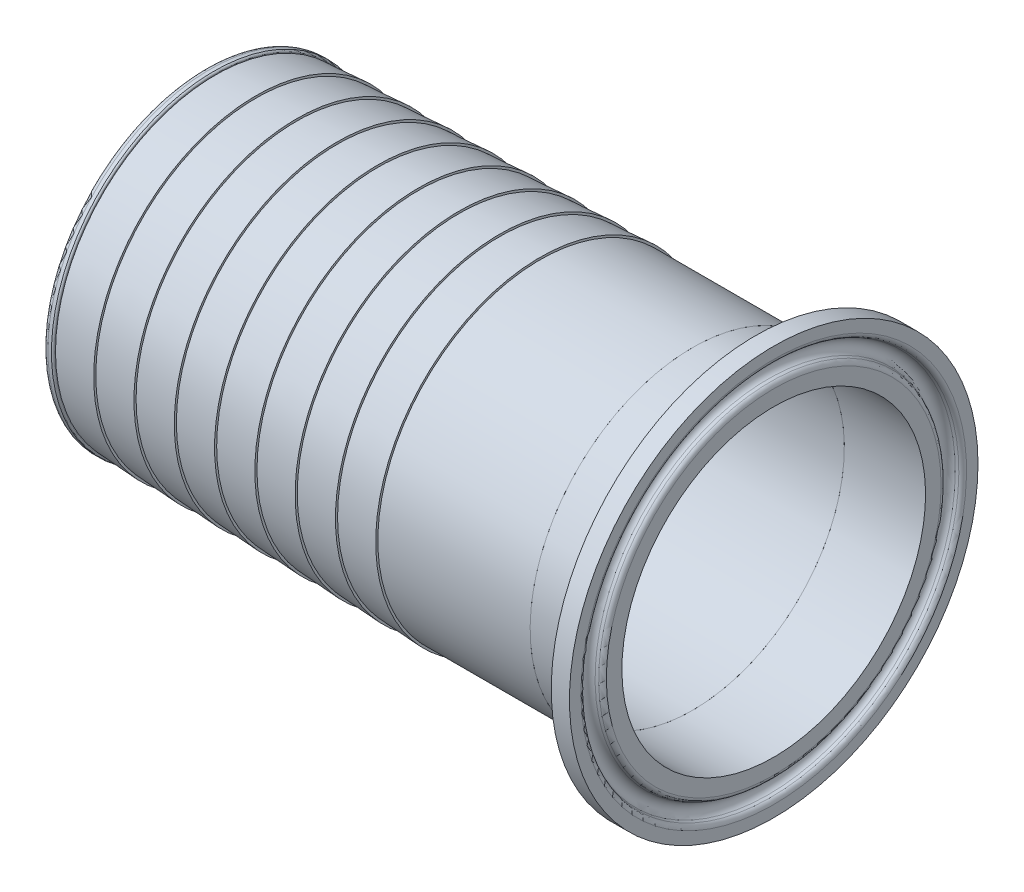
ISO-10303-21;
HEADER;
FILE_DESCRIPTION(('STEP AP214'),'2;1');
FILE_NAME('part.step','',(''),(''),'','','');
FILE_SCHEMA(('AUTOMOTIVE_DESIGN { 1 0 10303 214 1 1 1 1 }'));
ENDSEC;
DATA;
#1=APPLICATION_CONTEXT('core data for automotive mechanical design processes');
#2=APPLICATION_PROTOCOL_DEFINITION('international standard','automotive_design',2000,#1);
#3=PRODUCT_CONTEXT('',#1,'mechanical');
#4=PRODUCT('Part','Part','',(#3));
#5=PRODUCT_RELATED_PRODUCT_CATEGORY('part','',(#4));
#6=PRODUCT_DEFINITION_FORMATION('','',#4);
#7=PRODUCT_DEFINITION_CONTEXT('part definition',#1,'design');
#8=PRODUCT_DEFINITION('design','',#6,#7);
#9=PRODUCT_DEFINITION_SHAPE('','',#8);
#10=(LENGTH_UNIT() NAMED_UNIT(*) SI_UNIT(.MILLI.,.METRE.));
#11=(NAMED_UNIT(*) PLANE_ANGLE_UNIT() SI_UNIT($,.RADIAN.));
#12=(NAMED_UNIT(*) SI_UNIT($,.STERADIAN.) SOLID_ANGLE_UNIT());
#13=UNCERTAINTY_MEASURE_WITH_UNIT(LENGTH_MEASURE(1.E-05),#10,'distance_accuracy_value','');
#14=(GEOMETRIC_REPRESENTATION_CONTEXT(3) GLOBAL_UNCERTAINTY_ASSIGNED_CONTEXT((#13)) GLOBAL_UNIT_ASSIGNED_CONTEXT((#10,
#11,#12)) REPRESENTATION_CONTEXT('',''));
#15=CARTESIAN_POINT('',(0.,0.,0.));
#16=DIRECTION('',(0.,0.,1.));
#17=DIRECTION('',(1.,0.,0.));
#18=AXIS2_PLACEMENT_3D('',#15,#16,#17);
#19=CARTESIAN_POINT('',(42.6962816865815,64.7118525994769,51.277062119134));
#20=DIRECTION('',(1.,0.,0.));
#21=DIRECTION('',(0.,0.,-1.));
#22=AXIS2_PLACEMENT_3D('',#19,#20,#21);
#23=PLANE('',#22);
#24=CARTESIAN_POINT('',(42.6962816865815,39.3118525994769,51.277062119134));
#25=DIRECTION('',(1.,0.,0.));
#26=DIRECTION('',(0.,0.,-1.));
#27=AXIS2_PLACEMENT_3D('',#24,#25,#26);
#28=CIRCLE('',#27,23.749);
#29=CARTESIAN_POINT('',(42.6962816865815,39.3118525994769,27.528062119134));
#30=VERTEX_POINT('',#29);
#31=EDGE_CURVE('P0_E89',#30,#30,#28,.T.);
#32=ORIENTED_EDGE('',*,*,#31,.F.);
#33=EDGE_LOOP('',(#32));
#34=FACE_BOUND('',#33,.T.);
#35=CARTESIAN_POINT('',(42.6962816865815,39.3118525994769,51.277062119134));
#36=DIRECTION('',(1.,0.,0.));
#37=DIRECTION('',(0.,0.,-1.));
#38=AXIS2_PLACEMENT_3D('',#35,#36,#37);
#39=CIRCLE('',#38,25.4);
#40=CARTESIAN_POINT('',(42.6962816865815,39.3118525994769,25.877062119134));
#41=VERTEX_POINT('',#40);
#42=EDGE_CURVE('P0_E10',#41,#41,#39,.T.);
#43=ORIENTED_EDGE('',*,*,#42,.T.);
#44=EDGE_LOOP('',(#43));
#45=FACE_BOUND('',#44,.T.);
#46=ADVANCED_FACE('P0_F15',(#34,#45),#23,.T.);
#47=CARTESIAN_POINT('',(42.6962816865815,39.3118525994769,51.277062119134));
#48=DIRECTION('',(1.,0.,0.));
#49=DIRECTION('',(0.,0.,-1.));
#50=AXIS2_PLACEMENT_3D('',#47,#48,#49);
#51=CYLINDRICAL_SURFACE('',#50,25.4);
#52=CARTESIAN_POINT('',(18.8725980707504,39.3118525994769,51.277062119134));
#53=DIRECTION('',(1.,0.,0.));
#54=DIRECTION('',(0.,0.,-1.));
#55=AXIS2_PLACEMENT_3D('',#52,#53,#54);
#56=CIRCLE('',#55,25.4);
#57=CARTESIAN_POINT('',(18.8725980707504,39.3118525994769,25.877062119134));
#58=VERTEX_POINT('',#57);
#59=EDGE_CURVE('P0_E21',#58,#58,#56,.T.);
#60=ORIENTED_EDGE('',*,*,#59,.T.);
#61=EDGE_LOOP('',(#60));
#62=FACE_BOUND('',#61,.T.);
#63=ORIENTED_EDGE('',*,*,#42,.F.);
#64=EDGE_LOOP('',(#63));
#65=FACE_BOUND('',#64,.T.);
#66=ADVANCED_FACE('P0_F105',(#62,#65),#51,.T.);
#67=CARTESIAN_POINT('',(18.8726007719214,65.0452275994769,51.277062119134));
#68=DIRECTION('',(1.,0.,0.));
#69=DIRECTION('',(0.,0.,-1.));
#70=AXIS2_PLACEMENT_3D('',#67,#68,#69);
#71=PLANE('',#70);
#72=CARTESIAN_POINT('',(18.8726034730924,39.3118525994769,51.277062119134));
#73=DIRECTION('',(1.,0.,0.));
#74=DIRECTION('',(0.,0.,-1.));
#75=AXIS2_PLACEMENT_3D('',#72,#73,#74);
#76=CIRCLE('',#75,25.733375);
#77=CARTESIAN_POINT('',(18.8726034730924,39.3118525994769,25.543687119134));
#78=VERTEX_POINT('',#77);
#79=EDGE_CURVE('P0_E25',#78,#78,#76,.T.);
#80=ORIENTED_EDGE('',*,*,#79,.T.);
#81=EDGE_LOOP('',(#80));
#82=FACE_BOUND('',#81,.T.);
#83=ORIENTED_EDGE('',*,*,#59,.F.);
#84=EDGE_LOOP('',(#83));
#85=FACE_BOUND('',#84,.T.);
#86=ADVANCED_FACE('P0_F110',(#82,#85),#71,.T.);
#87=CARTESIAN_POINT('',(18.8726034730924,39.3118525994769,51.277062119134));
#88=DIRECTION('',(1.,0.,0.));
#89=DIRECTION('',(0.,0.,-1.));
#90=AXIS2_PLACEMENT_3D('',#87,#88,#89);
#91=CONICAL_SURFACE('',#90,25.733375,0.0599260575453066);
#92=CARTESIAN_POINT('',(12.5223806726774,39.3118525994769,51.277062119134));
#93=DIRECTION('',(1.,0.,0.));
#94=DIRECTION('',(0.,0.,-1.));
#95=AXIS2_PLACEMENT_3D('',#92,#93,#94);
#96=CIRCLE('',#95,25.352375);
#97=CARTESIAN_POINT('',(12.5223806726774,39.3118525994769,25.924687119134));
#98=VERTEX_POINT('',#97);
#99=EDGE_CURVE('P0_E29',#98,#98,#96,.T.);
#100=ORIENTED_EDGE('',*,*,#99,.T.);
#101=EDGE_LOOP('',(#100));
#102=FACE_BOUND('',#101,.T.);
#103=ORIENTED_EDGE('',*,*,#79,.F.);
#104=EDGE_LOOP('',(#103));
#105=FACE_BOUND('',#104,.T.);
#106=ADVANCED_FACE('P0_F114',(#102,#105),#91,.T.);
#107=CARTESIAN_POINT('',(12.5223833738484,64.9976025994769,51.277062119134));
#108=DIRECTION('',(1.,0.,0.));
#109=DIRECTION('',(0.,0.,-1.));
#110=AXIS2_PLACEMENT_3D('',#107,#108,#109);
#111=PLANE('',#110);
#112=CARTESIAN_POINT('',(12.5223860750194,39.3118525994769,51.277062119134));
#113=DIRECTION('',(1.,0.,0.));
#114=DIRECTION('',(0.,0.,-1.));
#115=AXIS2_PLACEMENT_3D('',#112,#113,#114);
#116=CIRCLE('',#115,25.68575);
#117=CARTESIAN_POINT('',(12.5223860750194,39.3118525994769,25.591312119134));
#118=VERTEX_POINT('',#117);
#119=EDGE_CURVE('P0_E34',#118,#118,#116,.T.);
#120=ORIENTED_EDGE('',*,*,#119,.T.);
#121=EDGE_LOOP('',(#120));
#122=FACE_BOUND('',#121,.T.);
#123=ORIENTED_EDGE('',*,*,#99,.F.);
#124=EDGE_LOOP('',(#123));
#125=FACE_BOUND('',#124,.T.);
#126=ADVANCED_FACE('P0_F121',(#122,#125),#111,.T.);
#127=CARTESIAN_POINT('',(12.5223860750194,39.3118525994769,51.277062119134));
#128=DIRECTION('',(1.,0.,0.));
#129=DIRECTION('',(0.,0.,-1.));
#130=AXIS2_PLACEMENT_3D('',#127,#128,#129);
#131=CONICAL_SURFACE('',#130,25.68575,0.0599260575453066);
#132=CARTESIAN_POINT('',(6.17216327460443,39.3118525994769,51.277062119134));
#133=DIRECTION('',(1.,0.,0.));
#134=DIRECTION('',(0.,0.,-1.));
#135=AXIS2_PLACEMENT_3D('',#132,#133,#134);
#136=CIRCLE('',#135,25.30475);
#137=CARTESIAN_POINT('',(6.17216327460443,39.3118525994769,25.972312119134));
#138=VERTEX_POINT('',#137);
#139=EDGE_CURVE('P0_E37',#138,#138,#136,.T.);
#140=ORIENTED_EDGE('',*,*,#139,.T.);
#141=EDGE_LOOP('',(#140));
#142=FACE_BOUND('',#141,.T.);
#143=ORIENTED_EDGE('',*,*,#119,.F.);
#144=EDGE_LOOP('',(#143));
#145=FACE_BOUND('',#144,.T.);
#146=ADVANCED_FACE('P0_F125',(#142,#145),#131,.T.);
#147=CARTESIAN_POINT('',(6.17216597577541,64.9499775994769,51.277062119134));
#148=DIRECTION('',(1.,0.,0.));
#149=DIRECTION('',(0.,0.,-1.));
#150=AXIS2_PLACEMENT_3D('',#147,#148,#149);
#151=PLANE('',#150);
#152=CARTESIAN_POINT('',(6.17216867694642,39.3118525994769,51.277062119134));
#153=DIRECTION('',(1.,0.,0.));
#154=DIRECTION('',(0.,0.,-1.));
#155=AXIS2_PLACEMENT_3D('',#152,#153,#154);
#156=CIRCLE('',#155,25.638125);
#157=CARTESIAN_POINT('',(6.17216867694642,39.3118525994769,25.638937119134));
#158=VERTEX_POINT('',#157);
#159=EDGE_CURVE('P0_E40',#158,#158,#156,.T.);
#160=ORIENTED_EDGE('',*,*,#159,.T.);
#161=EDGE_LOOP('',(#160));
#162=FACE_BOUND('',#161,.T.);
#163=ORIENTED_EDGE('',*,*,#139,.F.);
#164=EDGE_LOOP('',(#163));
#165=FACE_BOUND('',#164,.T.);
#166=ADVANCED_FACE('P0_F129',(#162,#165),#151,.T.);
#167=CARTESIAN_POINT('',(6.17216867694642,39.3118525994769,51.277062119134));
#168=DIRECTION('',(1.,0.,0.));
#169=DIRECTION('',(0.,0.,-1.));
#170=AXIS2_PLACEMENT_3D('',#167,#168,#169);
#171=CONICAL_SURFACE('',#170,25.638125,0.0599260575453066);
#172=CARTESIAN_POINT('',(-0.178054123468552,39.3118525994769,51.277062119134));
#173=DIRECTION('',(1.,0.,0.));
#174=DIRECTION('',(0.,0.,-1.));
#175=AXIS2_PLACEMENT_3D('',#172,#173,#174);
#176=CIRCLE('',#175,25.257125);
#177=CARTESIAN_POINT('',(-0.178054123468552,39.3118525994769,26.019937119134));
#178=VERTEX_POINT('',#177);
#179=EDGE_CURVE('P0_E43',#178,#178,#176,.T.);
#180=ORIENTED_EDGE('',*,*,#179,.T.);
#181=EDGE_LOOP('',(#180));
#182=FACE_BOUND('',#181,.T.);
#183=ORIENTED_EDGE('',*,*,#159,.F.);
#184=EDGE_LOOP('',(#183));
#185=FACE_BOUND('',#184,.T.);
#186=ADVANCED_FACE('P0_F133',(#182,#185),#171,.T.);
#187=CARTESIAN_POINT('',(-0.178051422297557,64.9023525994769,51.277062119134));
#188=DIRECTION('',(1.,0.,0.));
#189=DIRECTION('',(0.,0.,-1.));
#190=AXIS2_PLACEMENT_3D('',#187,#188,#189);
#191=PLANE('',#190);
#192=CARTESIAN_POINT('',(-0.178048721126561,39.3118525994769,51.277062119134));
#193=DIRECTION('',(1.,0.,0.));
#194=DIRECTION('',(0.,0.,-1.));
#195=AXIS2_PLACEMENT_3D('',#192,#193,#194);
#196=CIRCLE('',#195,25.5905);
#197=CARTESIAN_POINT('',(-0.178048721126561,39.3118525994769,25.686562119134));
#198=VERTEX_POINT('',#197);
#199=EDGE_CURVE('P0_E46',#198,#198,#196,.T.);
#200=ORIENTED_EDGE('',*,*,#199,.T.);
#201=EDGE_LOOP('',(#200));
#202=FACE_BOUND('',#201,.T.);
#203=ORIENTED_EDGE('',*,*,#179,.F.);
#204=EDGE_LOOP('',(#203));
#205=FACE_BOUND('',#204,.T.);
#206=ADVANCED_FACE('P0_F137',(#202,#205),#191,.T.);
#207=CARTESIAN_POINT('',(-0.178048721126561,39.3118525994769,51.277062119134));
#208=DIRECTION('',(1.,0.,0.));
#209=DIRECTION('',(0.,0.,-1.));
#210=AXIS2_PLACEMENT_3D('',#207,#208,#209);
#211=CONICAL_SURFACE('',#210,25.5905,0.0599260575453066);
#212=CARTESIAN_POINT('',(-6.52827152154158,39.3118525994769,51.277062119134));
#213=DIRECTION('',(1.,0.,0.));
#214=DIRECTION('',(0.,0.,-1.));
#215=AXIS2_PLACEMENT_3D('',#212,#213,#214);
#216=CIRCLE('',#215,25.2095);
#217=CARTESIAN_POINT('',(-6.52827152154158,39.3118525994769,26.067562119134));
#218=VERTEX_POINT('',#217);
#219=EDGE_CURVE('P0_E49',#218,#218,#216,.T.);
#220=ORIENTED_EDGE('',*,*,#219,.T.);
#221=EDGE_LOOP('',(#220));
#222=FACE_BOUND('',#221,.T.);
#223=ORIENTED_EDGE('',*,*,#199,.F.);
#224=EDGE_LOOP('',(#223));
#225=FACE_BOUND('',#224,.T.);
#226=ADVANCED_FACE('P0_F141',(#222,#225),#211,.T.);
#227=CARTESIAN_POINT('',(-6.52826882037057,64.8547275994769,51.277062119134));
#228=DIRECTION('',(1.,0.,0.));
#229=DIRECTION('',(0.,0.,-1.));
#230=AXIS2_PLACEMENT_3D('',#227,#228,#229);
#231=PLANE('',#230);
#232=CARTESIAN_POINT('',(-6.52826611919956,39.3118525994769,51.277062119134));
#233=DIRECTION('',(1.,0.,0.));
#234=DIRECTION('',(0.,0.,-1.));
#235=AXIS2_PLACEMENT_3D('',#232,#233,#234);
#236=CIRCLE('',#235,25.542875);
#237=CARTESIAN_POINT('',(-6.52826611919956,39.3118525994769,25.734187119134));
#238=VERTEX_POINT('',#237);
#239=EDGE_CURVE('P0_E52',#238,#238,#236,.T.);
#240=ORIENTED_EDGE('',*,*,#239,.T.);
#241=EDGE_LOOP('',(#240));
#242=FACE_BOUND('',#241,.T.);
#243=ORIENTED_EDGE('',*,*,#219,.F.);
#244=EDGE_LOOP('',(#243));
#245=FACE_BOUND('',#244,.T.);
#246=ADVANCED_FACE('P0_F145',(#242,#245),#231,.T.);
#247=CARTESIAN_POINT('',(-6.52826611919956,39.3118525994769,51.277062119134));
#248=DIRECTION('',(1.,0.,0.));
#249=DIRECTION('',(0.,0.,-1.));
#250=AXIS2_PLACEMENT_3D('',#247,#248,#249);
#251=CONICAL_SURFACE('',#250,25.542875,0.0599260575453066);
#252=CARTESIAN_POINT('',(-12.8784889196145,39.3118525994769,51.277062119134));
#253=DIRECTION('',(1.,0.,0.));
#254=DIRECTION('',(0.,0.,-1.));
#255=AXIS2_PLACEMENT_3D('',#252,#253,#254);
#256=CIRCLE('',#255,25.161875);
#257=CARTESIAN_POINT('',(-12.8784889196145,39.3118525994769,26.115187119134));
#258=VERTEX_POINT('',#257);
#259=EDGE_CURVE('P0_E55',#258,#258,#256,.T.);
#260=ORIENTED_EDGE('',*,*,#259,.T.);
#261=EDGE_LOOP('',(#260));
#262=FACE_BOUND('',#261,.T.);
#263=ORIENTED_EDGE('',*,*,#239,.F.);
#264=EDGE_LOOP('',(#263));
#265=FACE_BOUND('',#264,.T.);
#266=ADVANCED_FACE('P0_F149',(#262,#265),#251,.T.);
#267=CARTESIAN_POINT('',(-12.8784862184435,64.8071025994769,51.277062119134));
#268=DIRECTION('',(1.,0.,0.));
#269=DIRECTION('',(0.,0.,-1.));
#270=AXIS2_PLACEMENT_3D('',#267,#268,#269);
#271=PLANE('',#270);
#272=CARTESIAN_POINT('',(-12.8784835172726,39.3118525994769,51.277062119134));
#273=DIRECTION('',(1.,0.,0.));
#274=DIRECTION('',(0.,0.,-1.));
#275=AXIS2_PLACEMENT_3D('',#272,#273,#274);
#276=CIRCLE('',#275,25.49525);
#277=CARTESIAN_POINT('',(-12.8784835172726,39.3118525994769,25.781812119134));
#278=VERTEX_POINT('',#277);
#279=EDGE_CURVE('P0_E58',#278,#278,#276,.T.);
#280=ORIENTED_EDGE('',*,*,#279,.T.);
#281=EDGE_LOOP('',(#280));
#282=FACE_BOUND('',#281,.T.);
#283=ORIENTED_EDGE('',*,*,#259,.F.);
#284=EDGE_LOOP('',(#283));
#285=FACE_BOUND('',#284,.T.);
#286=ADVANCED_FACE('P0_F153',(#282,#285),#271,.T.);
#287=CARTESIAN_POINT('',(-12.8784835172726,39.3118525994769,51.277062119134));
#288=DIRECTION('',(1.,0.,0.));
#289=DIRECTION('',(0.,0.,-1.));
#290=AXIS2_PLACEMENT_3D('',#287,#288,#289);
#291=CONICAL_SURFACE('',#290,25.49525,0.0599260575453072);
#292=CARTESIAN_POINT('',(-19.2287063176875,39.3118525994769,51.277062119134));
#293=DIRECTION('',(1.,0.,0.));
#294=DIRECTION('',(0.,0.,-1.));
#295=AXIS2_PLACEMENT_3D('',#292,#293,#294);
#296=CIRCLE('',#295,25.11425);
#297=CARTESIAN_POINT('',(-19.2287063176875,39.3118525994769,26.162812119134));
#298=VERTEX_POINT('',#297);
#299=EDGE_CURVE('P0_E61',#298,#298,#296,.T.);
#300=ORIENTED_EDGE('',*,*,#299,.T.);
#301=EDGE_LOOP('',(#300));
#302=FACE_BOUND('',#301,.T.);
#303=ORIENTED_EDGE('',*,*,#279,.F.);
#304=EDGE_LOOP('',(#303));
#305=FACE_BOUND('',#304,.T.);
#306=ADVANCED_FACE('P0_F157',(#302,#305),#291,.T.);
#307=CARTESIAN_POINT('',(-19.2287036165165,64.7594775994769,51.277062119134));
#308=DIRECTION('',(1.,0.,0.));
#309=DIRECTION('',(0.,0.,-1.));
#310=AXIS2_PLACEMENT_3D('',#307,#308,#309);
#311=PLANE('',#310);
#312=CARTESIAN_POINT('',(-19.2287009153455,39.3118525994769,51.277062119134));
#313=DIRECTION('',(1.,0.,0.));
#314=DIRECTION('',(0.,0.,-1.));
#315=AXIS2_PLACEMENT_3D('',#312,#313,#314);
#316=CIRCLE('',#315,25.447625);
#317=CARTESIAN_POINT('',(-19.2287009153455,39.3118525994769,25.829437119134));
#318=VERTEX_POINT('',#317);
#319=EDGE_CURVE('P0_E64',#318,#318,#316,.T.);
#320=ORIENTED_EDGE('',*,*,#319,.T.);
#321=EDGE_LOOP('',(#320));
#322=FACE_BOUND('',#321,.T.);
#323=ORIENTED_EDGE('',*,*,#299,.F.);
#324=EDGE_LOOP('',(#323));
#325=FACE_BOUND('',#324,.T.);
#326=ADVANCED_FACE('P0_F161',(#322,#325),#311,.T.);
#327=CARTESIAN_POINT('',(-19.2287009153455,39.3118525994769,51.277062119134));
#328=DIRECTION('',(1.,0.,0.));
#329=DIRECTION('',(0.,0.,-1.));
#330=AXIS2_PLACEMENT_3D('',#327,#328,#329);
#331=CONICAL_SURFACE('',#330,25.447625,0.0599260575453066);
#332=CARTESIAN_POINT('',(-25.5789237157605,39.3118525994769,51.277062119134));
#333=DIRECTION('',(1.,0.,0.));
#334=DIRECTION('',(0.,0.,-1.));
#335=AXIS2_PLACEMENT_3D('',#332,#333,#334);
#336=CIRCLE('',#335,25.066625);
#337=CARTESIAN_POINT('',(-25.5789237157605,39.3118525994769,26.210437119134));
#338=VERTEX_POINT('',#337);
#339=EDGE_CURVE('P0_E67',#338,#338,#336,.T.);
#340=ORIENTED_EDGE('',*,*,#339,.T.);
#341=EDGE_LOOP('',(#340));
#342=FACE_BOUND('',#341,.T.);
#343=ORIENTED_EDGE('',*,*,#319,.F.);
#344=EDGE_LOOP('',(#343));
#345=FACE_BOUND('',#344,.T.);
#346=ADVANCED_FACE('P0_F165',(#342,#345),#331,.T.);
#347=CARTESIAN_POINT('',(-25.5789210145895,64.7118525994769,51.2770621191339));
#348=DIRECTION('',(1.,0.,0.));
#349=DIRECTION('',(0.,0.,-1.));
#350=AXIS2_PLACEMENT_3D('',#347,#348,#349);
#351=PLANE('',#350);
#352=CARTESIAN_POINT('',(-25.5789183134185,39.3118525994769,51.277062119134));
#353=DIRECTION('',(1.,0.,0.));
#354=DIRECTION('',(0.,0.,-1.));
#355=AXIS2_PLACEMENT_3D('',#352,#353,#354);
#356=CIRCLE('',#355,25.4);
#357=CARTESIAN_POINT('',(-25.5789183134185,39.3118525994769,25.877062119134));
#358=VERTEX_POINT('',#357);
#359=EDGE_CURVE('P0_E70',#358,#358,#356,.T.);
#360=ORIENTED_EDGE('',*,*,#359,.T.);
#361=EDGE_LOOP('',(#360));
#362=FACE_BOUND('',#361,.T.);
#363=ORIENTED_EDGE('',*,*,#339,.F.);
#364=EDGE_LOOP('',(#363));
#365=FACE_BOUND('',#364,.T.);
#366=ADVANCED_FACE('P0_F169',(#362,#365),#351,.T.);
#367=CARTESIAN_POINT('',(-25.5789183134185,39.3118525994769,51.277062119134));
#368=DIRECTION('',(1.,0.,0.));
#369=DIRECTION('',(0.,0.,-1.));
#370=AXIS2_PLACEMENT_3D('',#367,#368,#369);
#371=CONICAL_SURFACE('',#370,25.4,0.0599260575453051);
#372=CARTESIAN_POINT('',(-31.9291411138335,39.3118525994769,51.277062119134));
#373=DIRECTION('',(1.,0.,0.));
#374=DIRECTION('',(0.,0.,-1.));
#375=AXIS2_PLACEMENT_3D('',#372,#373,#374);
#376=CIRCLE('',#375,25.019);
#377=CARTESIAN_POINT('',(-31.9291411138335,39.3118525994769,26.258062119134));
#378=VERTEX_POINT('',#377);
#379=EDGE_CURVE('P0_E73',#378,#378,#376,.T.);
#380=ORIENTED_EDGE('',*,*,#379,.T.);
#381=EDGE_LOOP('',(#380));
#382=FACE_BOUND('',#381,.T.);
#383=ORIENTED_EDGE('',*,*,#359,.F.);
#384=EDGE_LOOP('',(#383));
#385=FACE_BOUND('',#384,.T.);
#386=ADVANCED_FACE('P0_F173',(#382,#385),#371,.T.);
#387=CARTESIAN_POINT('',(-31.9291411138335,39.3118525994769,51.277062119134));
#388=DIRECTION('',(1.,0.,0.));
#389=DIRECTION('',(0.,0.,-1.));
#390=AXIS2_PLACEMENT_3D('',#387,#388,#389);
#391=CONICAL_SURFACE('',#390,25.019,1.57021154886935);
#392=CARTESIAN_POINT('',(-31.9290669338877,39.3118525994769,51.277062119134));
#393=DIRECTION('',(1.,0.,0.));
#394=DIRECTION('',(0.,0.,-1.));
#395=AXIS2_PLACEMENT_3D('',#392,#393,#394);
#396=CIRCLE('',#395,25.1458514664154);
#397=CARTESIAN_POINT('',(-31.9290669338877,39.3118525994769,26.1312106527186));
#398=VERTEX_POINT('',#397);
#399=EDGE_CURVE('P0_E76',#398,#398,#396,.T.);
#400=ORIENTED_EDGE('',*,*,#399,.T.);
#401=EDGE_LOOP('',(#400));
#402=FACE_BOUND('',#401,.T.);
#403=ORIENTED_EDGE('',*,*,#379,.F.);
#404=EDGE_LOOP('',(#403));
#405=FACE_BOUND('',#404,.T.);
#406=ADVANCED_FACE('P0_F177',(#402,#405),#391,.F.);
#407=CARTESIAN_POINT('',(-32.1830668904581,39.3118525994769,51.277062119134));
#408=DIRECTION('',(1.,0.,0.));
#409=DIRECTION('',(0.,0.,-1.));
#410=AXIS2_PLACEMENT_3D('',#407,#408,#409);
#411=TOROIDAL_SURFACE('',#410,25.146,0.254000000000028);
#412=CARTESIAN_POINT('',(-32.1830668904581,39.3118525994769,51.277062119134));
#413=DIRECTION('',(1.,0.,0.));
#414=DIRECTION('',(0.,0.,-1.));
#415=AXIS2_PLACEMENT_3D('',#412,#413,#414);
#416=CIRCLE('',#415,25.4);
#417=CARTESIAN_POINT('',(-32.1830668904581,39.3118525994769,25.877062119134));
#418=VERTEX_POINT('',#417);
#419=EDGE_CURVE('P0_E79',#418,#418,#416,.T.);
#420=ORIENTED_EDGE('',*,*,#419,.T.);
#421=EDGE_LOOP('',(#420));
#422=FACE_BOUND('',#421,.T.);
#423=ORIENTED_EDGE('',*,*,#399,.F.);
#424=EDGE_LOOP('',(#423));
#425=FACE_BOUND('',#424,.T.);
#426=ADVANCED_FACE('P0_F181',(#422,#425),#411,.T.);
#427=CARTESIAN_POINT('',(42.6962816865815,39.3118525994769,51.277062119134));
#428=DIRECTION('',(1.,0.,0.));
#429=DIRECTION('',(0.,0.,-1.));
#430=AXIS2_PLACEMENT_3D('',#427,#428,#429);
#431=CYLINDRICAL_SURFACE('',#430,25.4);
#432=CARTESIAN_POINT('',(-32.7417183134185,39.3118525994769,51.277062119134));
#433=DIRECTION('',(1.,0.,0.));
#434=DIRECTION('',(0.,0.,-1.));
#435=AXIS2_PLACEMENT_3D('',#432,#433,#434);
#436=CIRCLE('',#435,25.4);
#437=CARTESIAN_POINT('',(-32.7417183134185,39.3118525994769,25.877062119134));
#438=VERTEX_POINT('',#437);
#439=EDGE_CURVE('P0_E82',#438,#438,#436,.T.);
#440=ORIENTED_EDGE('',*,*,#439,.T.);
#441=EDGE_LOOP('',(#440));
#442=FACE_BOUND('',#441,.T.);
#443=ORIENTED_EDGE('',*,*,#419,.F.);
#444=EDGE_LOOP('',(#443));
#445=FACE_BOUND('',#444,.T.);
#446=ADVANCED_FACE('P0_F185',(#442,#445),#431,.T.);
#447=CARTESIAN_POINT('',(-32.7417183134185,39.3118525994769,51.277062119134));
#448=DIRECTION('',(1.,0.,0.));
#449=DIRECTION('',(0.,0.,-1.));
#450=AXIS2_PLACEMENT_3D('',#447,#448,#449);
#451=TOROIDAL_SURFACE('',#450,24.638,0.761999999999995);
#452=CARTESIAN_POINT('',(-33.5037183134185,39.3118525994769,51.277062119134));
#453=DIRECTION('',(1.,0.,0.));
#454=DIRECTION('',(0.,0.,-1.));
#455=AXIS2_PLACEMENT_3D('',#452,#453,#454);
#456=CIRCLE('',#455,24.638);
#457=CARTESIAN_POINT('',(-33.5037183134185,39.3118525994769,26.639062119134));
#458=VERTEX_POINT('',#457);
#459=EDGE_CURVE('P0_E85',#458,#458,#456,.T.);
#460=ORIENTED_EDGE('',*,*,#459,.T.);
#461=EDGE_LOOP('',(#460));
#462=FACE_BOUND('',#461,.T.);
#463=ORIENTED_EDGE('',*,*,#439,.F.);
#464=EDGE_LOOP('',(#463));
#465=FACE_BOUND('',#464,.T.);
#466=ADVANCED_FACE('P0_F189',(#462,#465),#451,.T.);
#467=CARTESIAN_POINT('',(-33.5037183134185,39.3118525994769,51.277062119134));
#468=DIRECTION('',(-1.,0.,0.));
#469=DIRECTION('',(0.,0.,1.));
#470=AXIS2_PLACEMENT_3D('',#467,#468,#469);
#471=PLANE('',#470);
#472=CARTESIAN_POINT('',(-33.5037183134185,39.3118525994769,51.277062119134));
#473=DIRECTION('',(1.,0.,0.));
#474=DIRECTION('',(0.,0.,-1.));
#475=AXIS2_PLACEMENT_3D('',#472,#473,#474);
#476=CIRCLE('',#475,23.749);
#477=CARTESIAN_POINT('',(-33.5037183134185,39.3118525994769,27.528062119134));
#478=VERTEX_POINT('',#477);
#479=EDGE_CURVE('P0_E88',#478,#478,#476,.T.);
#480=ORIENTED_EDGE('',*,*,#479,.T.);
#481=EDGE_LOOP('',(#480));
#482=FACE_BOUND('',#481,.T.);
#483=ORIENTED_EDGE('',*,*,#459,.F.);
#484=EDGE_LOOP('',(#483));
#485=FACE_BOUND('',#484,.T.);
#486=ADVANCED_FACE('P0_F95',(#482,#485),#471,.T.);
#487=CARTESIAN_POINT('',(-33.5037183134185,39.3118525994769,51.277062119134));
#488=DIRECTION('',(1.,0.,0.));
#489=DIRECTION('',(0.,0.,-1.));
#490=AXIS2_PLACEMENT_3D('',#487,#488,#489);
#491=CYLINDRICAL_SURFACE('',#490,23.749);
#492=CARTESIAN_POINT('',(-33.5037183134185,39.3118525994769,27.528062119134));
#493=CARTESIAN_POINT('',(-32.7099683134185,39.3118525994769,27.528062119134));
#494=CARTESIAN_POINT('',(-31.9162183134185,39.3118525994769,27.528062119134));
#495=CARTESIAN_POINT('',(-30.3287183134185,39.3118525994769,27.528062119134));
#496=CARTESIAN_POINT('',(-29.5349683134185,39.3118525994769,27.528062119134));
#497=CARTESIAN_POINT('',(-27.9474683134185,39.3118525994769,27.528062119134));
#498=CARTESIAN_POINT('',(-27.1537183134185,39.3118525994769,27.528062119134));
#499=CARTESIAN_POINT('',(-25.5662183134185,39.3118525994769,27.528062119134));
#500=CARTESIAN_POINT('',(-24.7724683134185,39.3118525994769,27.528062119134));
#501=CARTESIAN_POINT('',(-23.1849683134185,39.3118525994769,27.528062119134));
#502=CARTESIAN_POINT('',(-22.3912183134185,39.3118525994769,27.528062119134));
#503=CARTESIAN_POINT('',(-20.8037183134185,39.3118525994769,27.528062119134));
#504=CARTESIAN_POINT('',(-20.0099683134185,39.3118525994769,27.528062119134));
#505=CARTESIAN_POINT('',(-18.4224683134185,39.3118525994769,27.528062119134));
#506=CARTESIAN_POINT('',(-17.6287183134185,39.3118525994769,27.528062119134));
#507=CARTESIAN_POINT('',(-16.0412183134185,39.3118525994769,27.528062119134));
#508=CARTESIAN_POINT('',(-15.2474683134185,39.3118525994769,27.528062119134));
#509=CARTESIAN_POINT('',(-13.6599683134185,39.3118525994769,27.528062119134));
#510=CARTESIAN_POINT('',(-12.8662183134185,39.3118525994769,27.528062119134));
#511=CARTESIAN_POINT('',(-11.2787183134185,39.3118525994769,27.528062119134));
#512=CARTESIAN_POINT('',(-10.4849683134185,39.3118525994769,27.528062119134));
#513=CARTESIAN_POINT('',(-8.89746831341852,39.3118525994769,27.528062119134));
#514=CARTESIAN_POINT('',(-8.10371831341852,39.3118525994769,27.528062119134));
#515=CARTESIAN_POINT('',(-6.51621831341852,39.3118525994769,27.528062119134));
#516=CARTESIAN_POINT('',(-5.72246831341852,39.3118525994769,27.528062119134));
#517=CARTESIAN_POINT('',(-4.13496831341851,39.3118525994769,27.528062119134));
#518=CARTESIAN_POINT('',(-3.34121831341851,39.3118525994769,27.528062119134));
#519=CARTESIAN_POINT('',(-1.75371831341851,39.3118525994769,27.528062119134));
#520=CARTESIAN_POINT('',(-0.959968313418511,39.3118525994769,27.528062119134));
#521=CARTESIAN_POINT('',(0.627531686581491,39.3118525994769,27.528062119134));
#522=CARTESIAN_POINT('',(1.42128168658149,39.3118525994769,27.528062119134));
#523=CARTESIAN_POINT('',(3.00878168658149,39.3118525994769,27.528062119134));
#524=CARTESIAN_POINT('',(3.80253168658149,39.3118525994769,27.528062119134));
#525=CARTESIAN_POINT('',(5.39003168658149,39.3118525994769,27.528062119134));
#526=CARTESIAN_POINT('',(6.18378168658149,39.3118525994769,27.528062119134));
#527=CARTESIAN_POINT('',(7.7712816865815,39.3118525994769,27.528062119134));
#528=CARTESIAN_POINT('',(8.5650316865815,39.3118525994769,27.528062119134));
#529=CARTESIAN_POINT('',(10.1525316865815,39.3118525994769,27.528062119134));
#530=CARTESIAN_POINT('',(10.9462816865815,39.3118525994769,27.528062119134));
#531=CARTESIAN_POINT('',(12.5337816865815,39.3118525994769,27.528062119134));
#532=CARTESIAN_POINT('',(13.3275316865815,39.3118525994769,27.528062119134));
#533=CARTESIAN_POINT('',(14.9150316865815,39.3118525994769,27.528062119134));
#534=CARTESIAN_POINT('',(15.7087816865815,39.3118525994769,27.528062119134));
#535=CARTESIAN_POINT('',(17.2962816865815,39.3118525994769,27.528062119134));
#536=CARTESIAN_POINT('',(18.0900316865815,39.3118525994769,27.528062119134));
#537=CARTESIAN_POINT('',(19.6775316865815,39.3118525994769,27.528062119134));
#538=CARTESIAN_POINT('',(20.4712816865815,39.3118525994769,27.528062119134));
#539=CARTESIAN_POINT('',(22.0587816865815,39.3118525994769,27.528062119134));
#540=CARTESIAN_POINT('',(22.8525316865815,39.3118525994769,27.528062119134));
#541=CARTESIAN_POINT('',(24.4400316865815,39.3118525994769,27.528062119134));
#542=CARTESIAN_POINT('',(25.2337816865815,39.3118525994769,27.528062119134));
#543=CARTESIAN_POINT('',(26.8212816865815,39.3118525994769,27.528062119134));
#544=CARTESIAN_POINT('',(27.6150316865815,39.3118525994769,27.528062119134));
#545=CARTESIAN_POINT('',(29.2025316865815,39.3118525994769,27.528062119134));
#546=CARTESIAN_POINT('',(29.9962816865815,39.3118525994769,27.528062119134));
#547=CARTESIAN_POINT('',(31.5837816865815,39.3118525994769,27.528062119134));
#548=CARTESIAN_POINT('',(32.3775316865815,39.3118525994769,27.528062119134));
#549=CARTESIAN_POINT('',(33.9650316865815,39.3118525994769,27.528062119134));
#550=CARTESIAN_POINT('',(34.7587816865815,39.3118525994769,27.528062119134));
#551=CARTESIAN_POINT('',(36.3462816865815,39.3118525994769,27.528062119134));
#552=CARTESIAN_POINT('',(37.1400316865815,39.3118525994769,27.528062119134));
#553=CARTESIAN_POINT('',(38.7275316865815,39.3118525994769,27.528062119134));
#554=CARTESIAN_POINT('',(39.5212816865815,39.3118525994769,27.528062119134));
#555=CARTESIAN_POINT('',(41.1087816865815,39.3118525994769,27.528062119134));
#556=CARTESIAN_POINT('',(41.9025316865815,39.3118525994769,27.528062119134));
#557=CARTESIAN_POINT('',(42.6962816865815,39.3118525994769,27.528062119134));
#558=B_SPLINE_CURVE_WITH_KNOTS('',3,(#492,#493,#494,#495,#496,#497,#498,#499,#500,#501,#502,
#503,#504,#505,#506,#507,#508,#509,#510,#511,#512,#513,#514,#515,#516,#517,#518,#519,#520,#521,
#522,#523,#524,#525,#526,#527,#528,#529,#530,#531,#532,#533,#534,#535,#536,#537,#538,#539,#540,
#541,#542,#543,#544,#545,#546,#547,#548,#549,#550,#551,#552,#553,#554,#555,#556,#557),
.UNSPECIFIED.,.F.,.F.,(4,2,2,2,2,2,2,2,2,2,2,2,2,2,2,2,2,2,2,2,2,2,2,2,2,2,2,2,2,2,2,2,4),(0.,
2.38125,4.7625,7.14375,9.52500000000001,11.90625,14.2875,16.66875,19.05,21.43125,23.8125,
26.19375,28.575,30.95625,33.3375,35.71875,38.1,40.48125,42.8625,45.24375,47.625,50.00625,
52.3875,54.76875,57.15,59.53125,61.9125000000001,64.29375,66.675,69.05625,71.4375,
73.8187500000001,76.2),.UNSPECIFIED.);
#559=EDGE_CURVE('P0_BSEAM98',#478,#30,#558,.T.);
#560=ORIENTED_EDGE('',*,*,#479,.F.);
#561=ORIENTED_EDGE('',*,*,#31,.T.);
#562=ORIENTED_EDGE('',*,*,#559,.T.);
#563=ORIENTED_EDGE('',*,*,#559,.F.);
#564=EDGE_LOOP('',(#560,#562,#561,#563));
#565=FACE_BOUND('',#564,.T.);
#566=ADVANCED_FACE('P0_F98',(#565),#491,.F.);
#567=CLOSED_SHELL('',(#46,#66,#86,#106,#126,#146,#166,#186,#206,#226,#246,#266,#286,#306,#326,
#346,#366,#386,#406,#426,#446,#466,#486,#566));
#568=MANIFOLD_SOLID_BREP('P0_B1',#567);
#569=CARTESIAN_POINT('',(55.3962816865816,39.3118525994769,51.2770621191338));
#570=DIRECTION('',(-1.,0.,0.));
#571=DIRECTION('',(0.,0.96755107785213,-0.252675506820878));
#572=AXIS2_PLACEMENT_3D('',#569,#570,#571);
#573=PLANE('',#572);
#574=CARTESIAN_POINT('',(55.3962816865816,39.3118525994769,51.2770621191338));
#575=DIRECTION('',(1.,0.,0.));
#576=DIRECTION('',(0.,-0.96755107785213,0.252675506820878));
#577=AXIS2_PLACEMENT_3D('',#574,#575,#576);
#578=CIRCLE('',#577,30.1591722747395);
#579=CARTESIAN_POINT('',(55.3962816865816,10.1313129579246,58.8975462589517));
#580=VERTEX_POINT('',#579);
#581=EDGE_CURVE('P1_E9',#580,#580,#578,.T.);
#582=ORIENTED_EDGE('',*,*,#581,.F.);
#583=EDGE_LOOP('',(#582));
#584=FACE_BOUND('',#583,.T.);
#585=CARTESIAN_POINT('',(55.3962816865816,39.3118525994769,51.2770621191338));
#586=DIRECTION('',(1.,0.,0.));
#587=DIRECTION('',(0.,-0.96755107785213,0.252675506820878));
#588=AXIS2_PLACEMENT_3D('',#585,#586,#587);
#589=CIRCLE('',#588,31.9532);
#590=CARTESIAN_POINT('',(55.3962816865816,8.39549949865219,59.3508531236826));
#591=VERTEX_POINT('',#590);
#592=EDGE_CURVE('P1_E54',#591,#591,#589,.T.);
#593=ORIENTED_EDGE('',*,*,#592,.T.);
#594=EDGE_LOOP('',(#593));
#595=FACE_BOUND('',#594,.T.);
#596=ADVANCED_FACE('P1_F14',(#584,#595),#573,.F.);
#597=CARTESIAN_POINT('',(54.6088816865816,39.3118525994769,51.2770621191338));
#598=DIRECTION('',(1.,0.,0.));
#599=DIRECTION('',(0.,-0.96755107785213,0.252675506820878));
#600=AXIS2_PLACEMENT_3D('',#597,#598,#599);
#601=TOROIDAL_SURFACE('',#600,30.1591722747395,0.7874);
#602=CARTESIAN_POINT('',(54.9165433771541,39.3118525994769,51.2770621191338));
#603=DIRECTION('',(1.,0.,0.));
#604=DIRECTION('',(0.,-0.96755107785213,0.252675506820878));
#605=AXIS2_PLACEMENT_3D('',#602,#603,#604);
#606=CIRCLE('',#605,29.4343667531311);
#607=CARTESIAN_POINT('',(54.9165433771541,10.83259932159,58.7144056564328));
#608=VERTEX_POINT('',#607);
#609=EDGE_CURVE('P1_E20',#608,#608,#606,.T.);
#610=ORIENTED_EDGE('',*,*,#609,.F.);
#611=EDGE_LOOP('',(#610));
#612=FACE_BOUND('',#611,.T.);
#613=ORIENTED_EDGE('',*,*,#581,.T.);
#614=EDGE_LOOP('',(#613));
#615=FACE_BOUND('',#614,.T.);
#616=ADVANCED_FACE('P1_F96',(#612,#615),#601,.T.);
#617=CARTESIAN_POINT('',(54.5234268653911,39.3118525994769,51.2770621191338));
#618=DIRECTION('',(1.,0.,0.));
#619=DIRECTION('',(0.,-0.96755107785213,0.252675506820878));
#620=AXIS2_PLACEMENT_3D('',#617,#618,#619);
#621=CONICAL_SURFACE('',#620,29.2674986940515,0.401425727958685);
#622=ORIENTED_EDGE('',*,*,#609,.T.);
#623=EDGE_LOOP('',(#622));
#624=FACE_BOUND('',#623,.T.);
#625=CARTESIAN_POINT('',(54.5234268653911,39.3118525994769,51.2770621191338));
#626=DIRECTION('',(1.,0.,0.));
#627=DIRECTION('',(0.,-0.96755107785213,0.252675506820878));
#628=AXIS2_PLACEMENT_3D('',#625,#626,#627);
#629=CIRCLE('',#628,29.2674986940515);
#630=CARTESIAN_POINT('',(54.5234268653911,10.9940526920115,58.6722421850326));
#631=VERTEX_POINT('',#630);
#632=EDGE_CURVE('P1_E24',#631,#631,#629,.T.);
#633=ORIENTED_EDGE('',*,*,#632,.F.);
#634=EDGE_LOOP('',(#633));
#635=FACE_BOUND('',#634,.T.);
#636=ADVANCED_FACE('P1_F101',(#624,#635),#621,.F.);
#637=CARTESIAN_POINT('',(54.9898816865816,39.3118525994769,51.2770621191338));
#638=DIRECTION('',(1.,0.,0.));
#639=DIRECTION('',(0.,-0.96755107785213,0.252675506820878));
#640=AXIS2_PLACEMENT_3D('',#637,#638,#639);
#641=TOROIDAL_SURFACE('',#640,28.1686,1.1938);
#642=CARTESIAN_POINT('',(54.5234268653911,39.3118525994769,51.2770621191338));
#643=DIRECTION('',(1.,0.,0.));
#644=DIRECTION('',(0.,-0.96755107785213,0.252675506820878));
#645=AXIS2_PLACEMENT_3D('',#642,#643,#644);
#646=CIRCLE('',#645,27.0697013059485);
#647=CARTESIAN_POINT('',(54.5234268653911,13.1205339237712,58.1169126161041));
#648=VERTEX_POINT('',#647);
#649=EDGE_CURVE('P1_E28',#648,#648,#646,.T.);
#650=ORIENTED_EDGE('',*,*,#649,.F.);
#651=EDGE_LOOP('',(#650));
#652=FACE_BOUND('',#651,.T.);
#653=ORIENTED_EDGE('',*,*,#632,.T.);
#654=EDGE_LOOP('',(#653));
#655=FACE_BOUND('',#654,.T.);
#656=ADVANCED_FACE('P1_F106',(#652,#655),#641,.F.);
#657=CARTESIAN_POINT('',(54.5234268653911,39.3118525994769,51.2770621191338));
#658=DIRECTION('',(-1.,0.,0.));
#659=DIRECTION('',(0.,0.96755107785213,-0.252675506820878));
#660=AXIS2_PLACEMENT_3D('',#657,#658,#659);
#661=CONICAL_SURFACE('',#660,27.0697013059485,0.401425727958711);
#662=CARTESIAN_POINT('',(54.9165433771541,39.3118525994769,51.2770621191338));
#663=DIRECTION('',(1.,0.,0.));
#664=DIRECTION('',(0.,-0.96755107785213,0.252675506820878));
#665=AXIS2_PLACEMENT_3D('',#662,#663,#664);
#666=CIRCLE('',#665,26.9028332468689);
#667=CARTESIAN_POINT('',(54.9165433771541,13.2819872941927,58.0747491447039));
#668=VERTEX_POINT('',#667);
#669=EDGE_CURVE('P1_E33',#668,#668,#666,.T.);
#670=ORIENTED_EDGE('',*,*,#669,.F.);
#671=EDGE_LOOP('',(#670));
#672=FACE_BOUND('',#671,.T.);
#673=ORIENTED_EDGE('',*,*,#649,.T.);
#674=EDGE_LOOP('',(#673));
#675=FACE_BOUND('',#674,.T.);
#676=ADVANCED_FACE('P1_F111',(#672,#675),#661,.T.);
#677=CARTESIAN_POINT('',(54.6088816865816,39.3118525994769,51.2770621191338));
#678=DIRECTION('',(1.,0.,0.));
#679=DIRECTION('',(0.,-0.96755107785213,0.252675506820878));
#680=AXIS2_PLACEMENT_3D('',#677,#678,#679);
#681=TOROIDAL_SURFACE('',#680,26.1780277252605,0.787399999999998);
#682=ORIENTED_EDGE('',*,*,#669,.T.);
#683=EDGE_LOOP('',(#682));
#684=FACE_BOUND('',#683,.T.);
#685=CARTESIAN_POINT('',(55.3962816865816,39.3118525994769,51.2770621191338));
#686=DIRECTION('',(1.,0.,0.));
#687=DIRECTION('',(0.,-0.96755107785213,0.252675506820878));
#688=AXIS2_PLACEMENT_3D('',#685,#686,#687);
#689=CIRCLE('',#688,26.1780277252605);
#690=CARTESIAN_POINT('',(55.3962816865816,13.9832736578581,57.8916085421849));
#691=VERTEX_POINT('',#690);
#692=EDGE_CURVE('P1_E36',#691,#691,#689,.T.);
#693=ORIENTED_EDGE('',*,*,#692,.F.);
#694=EDGE_LOOP('',(#693));
#695=FACE_BOUND('',#694,.T.);
#696=ADVANCED_FACE('P1_F92',(#684,#695),#681,.T.);
#697=CARTESIAN_POINT('',(55.3962816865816,39.3118525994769,51.2770621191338));
#698=DIRECTION('',(-1.,0.,0.));
#699=DIRECTION('',(0.,0.96755107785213,-0.252675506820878));
#700=AXIS2_PLACEMENT_3D('',#697,#698,#699);
#701=PLANE('',#700);
#702=CARTESIAN_POINT('',(55.3962816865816,39.3118525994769,51.2770621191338));
#703=DIRECTION('',(1.,0.,0.));
#704=DIRECTION('',(0.,-0.96755107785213,0.252675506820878));
#705=AXIS2_PLACEMENT_3D('',#702,#703,#704);
#706=CIRCLE('',#705,23.749);
#707=CARTESIAN_POINT('',(55.3962816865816,16.3334820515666,57.2778527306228));
#708=VERTEX_POINT('',#707);
#709=EDGE_CURVE('P1_E39',#708,#708,#706,.T.);
#710=ORIENTED_EDGE('',*,*,#709,.F.);
#711=EDGE_LOOP('',(#710));
#712=FACE_BOUND('',#711,.T.);
#713=ORIENTED_EDGE('',*,*,#692,.T.);
#714=EDGE_LOOP('',(#713));
#715=FACE_BOUND('',#714,.T.);
#716=ADVANCED_FACE('P1_F85',(#712,#715),#701,.F.);
#717=CARTESIAN_POINT('',(55.3962816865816,39.3118525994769,51.2770621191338));
#718=DIRECTION('',(1.,0.,0.));
#719=DIRECTION('',(0.,-0.96755107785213,0.252675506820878));
#720=AXIS2_PLACEMENT_3D('',#717,#718,#719);
#721=CYLINDRICAL_SURFACE('',#720,23.749);
#722=ORIENTED_EDGE('',*,*,#709,.T.);
#723=EDGE_LOOP('',(#722));
#724=FACE_BOUND('',#723,.T.);
#725=CARTESIAN_POINT('',(42.6962816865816,39.3118525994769,51.2770621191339));
#726=DIRECTION('',(1.,0.,0.));
#727=DIRECTION('',(0.,-0.96755107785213,0.252675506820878));
#728=AXIS2_PLACEMENT_3D('',#725,#726,#727);
#729=CIRCLE('',#728,23.749);
#730=CARTESIAN_POINT('',(42.6962816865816,16.3334820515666,57.277852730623));
#731=VERTEX_POINT('',#730);
#732=EDGE_CURVE('P1_E42',#731,#731,#729,.T.);
#733=ORIENTED_EDGE('',*,*,#732,.F.);
#734=EDGE_LOOP('',(#733));
#735=FACE_BOUND('',#734,.T.);
#736=ADVANCED_FACE('P1_F80',(#724,#735),#721,.F.);
#737=CARTESIAN_POINT('',(42.6962816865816,39.3118525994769,51.2770621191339));
#738=DIRECTION('',(1.,0.,0.));
#739=DIRECTION('',(0.,-0.96755107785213,0.252675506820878));
#740=AXIS2_PLACEMENT_3D('',#737,#738,#739);
#741=PLANE('',#740);
#742=CARTESIAN_POINT('',(42.6962816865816,39.3118525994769,51.2770621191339));
#743=DIRECTION('',(1.,0.,0.));
#744=DIRECTION('',(0.,-0.96755107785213,0.252675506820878));
#745=AXIS2_PLACEMENT_3D('',#742,#743,#744);
#746=CIRCLE('',#745,25.4);
#747=CARTESIAN_POINT('',(42.6962816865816,14.7360552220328,57.6950199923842));
#748=VERTEX_POINT('',#747);
#749=EDGE_CURVE('P1_E45',#748,#748,#746,.T.);
#750=ORIENTED_EDGE('',*,*,#749,.F.);
#751=EDGE_LOOP('',(#750));
#752=FACE_BOUND('',#751,.T.);
#753=ORIENTED_EDGE('',*,*,#732,.T.);
#754=EDGE_LOOP('',(#753));
#755=FACE_BOUND('',#754,.T.);
#756=ADVANCED_FACE('P1_F74',(#752,#755),#741,.F.);
#757=CARTESIAN_POINT('',(55.3962816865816,39.3118525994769,51.2770621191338));
#758=DIRECTION('',(1.,0.,0.));
#759=DIRECTION('',(0.,-0.96755107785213,0.252675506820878));
#760=AXIS2_PLACEMENT_3D('',#757,#758,#759);
#761=CYLINDRICAL_SURFACE('',#760,25.4);
#762=CARTESIAN_POINT('',(50.1663119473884,39.3118525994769,51.277062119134));
#763=DIRECTION('',(1.,0.,0.));
#764=DIRECTION('',(0.,-0.96755107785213,0.252675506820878));
#765=AXIS2_PLACEMENT_3D('',#762,#763,#764);
#766=CIRCLE('',#765,25.4);
#767=CARTESIAN_POINT('',(50.1663119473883,14.7360552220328,57.6950199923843));
#768=VERTEX_POINT('',#767);
#769=EDGE_CURVE('P1_E48',#768,#768,#766,.T.);
#770=ORIENTED_EDGE('',*,*,#769,.F.);
#771=EDGE_LOOP('',(#770));
#772=FACE_BOUND('',#771,.T.);
#773=ORIENTED_EDGE('',*,*,#749,.T.);
#774=EDGE_LOOP('',(#773));
#775=FACE_BOUND('',#774,.T.);
#776=ADVANCED_FACE('P1_F68',(#772,#775),#761,.T.);
#777=CARTESIAN_POINT('',(50.1663119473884,39.3118525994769,51.277062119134));
#778=DIRECTION('',(1.,0.,0.));
#779=DIRECTION('',(0.,-0.96755107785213,0.252675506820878));
#780=AXIS2_PLACEMENT_3D('',#777,#778,#779);
#781=CONICAL_SURFACE('',#780,25.4,1.22173047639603);
#782=CARTESIAN_POINT('',(52.5514816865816,39.3118525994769,51.2770621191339));
#783=DIRECTION('',(1.,0.,0.));
#784=DIRECTION('',(0.,-0.96755107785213,0.252675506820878));
#785=AXIS2_PLACEMENT_3D('',#782,#783,#784);
#786=CIRCLE('',#785,31.9532);
#787=CARTESIAN_POINT('',(52.5514816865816,8.39549949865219,59.3508531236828));
#788=VERTEX_POINT('',#787);
#789=EDGE_CURVE('P1_E51',#788,#788,#786,.T.);
#790=ORIENTED_EDGE('',*,*,#789,.F.);
#791=EDGE_LOOP('',(#790));
#792=FACE_BOUND('',#791,.T.);
#793=ORIENTED_EDGE('',*,*,#769,.T.);
#794=EDGE_LOOP('',(#793));
#795=FACE_BOUND('',#794,.T.);
#796=ADVANCED_FACE('P1_F62',(#792,#795),#781,.T.);
#797=CARTESIAN_POINT('',(55.3962816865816,39.3118525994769,51.2770621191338));
#798=DIRECTION('',(1.,0.,0.));
#799=DIRECTION('',(0.,-0.96755107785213,0.252675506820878));
#800=AXIS2_PLACEMENT_3D('',#797,#798,#799);
#801=CYLINDRICAL_SURFACE('',#800,31.9532);
#802=ORIENTED_EDGE('',*,*,#592,.F.);
#803=EDGE_LOOP('',(#802));
#804=FACE_BOUND('',#803,.T.);
#805=ORIENTED_EDGE('',*,*,#789,.T.);
#806=EDGE_LOOP('',(#805));
#807=FACE_BOUND('',#806,.T.);
#808=ADVANCED_FACE('P1_F59',(#804,#807),#801,.T.);
#809=CLOSED_SHELL('',(#596,#616,#636,#656,#676,#696,#716,#736,#756,#776,#796,#808));
#810=MANIFOLD_SOLID_BREP('P1_B1',#809);
#811=ADVANCED_BREP_SHAPE_REPRESENTATION('',(#18,#568,#810),#14);
#812=SHAPE_DEFINITION_REPRESENTATION(#9,#811);
ENDSEC;
END-ISO-10303-21;
